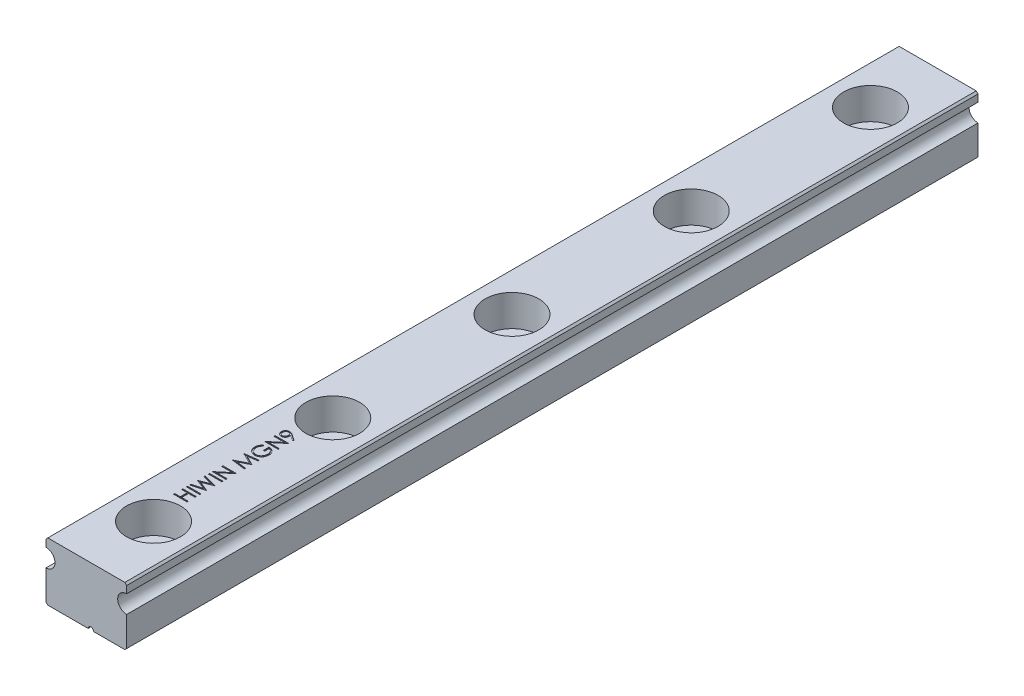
from build123d import *

# Parameters (mm, degrees)
EXTRUDE_1_DEPTH              = 95
HOLE_WIZARD_M3_1_D           = 3.5
HOLE_WIZARD_M3_1_CBORE_D     = 6
HOLE_WIZARD_M3_1_CBORE_DEPTH = 3.5
PATTERN_LINEAR_1_COUNT       = 5
PATTERN_LINEAR_1_PITCH       = 20
SKETCH_6_W                   = 1.5
SKETCH_6_H                   = 0.134615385
CUT_EXTRUDE_1_DEPTH          = 0.1


with BuildPart() as part:
    # Sketch 1 → Extrude 1 (new body)
    with BuildSketch(Plane.XY):
        with BuildLine():
            Line((4.5, 5.5), (4.5, 6.3))
            Line((4.5, 6.3), (4.3, 6.5))
            Line((4.3, 6.5), (-4.3, 6.5))
            Line((-4.3, 6.5), (-4.5, 6.3))
            Line((-4.5, 6.3), (-4.5, 5.5))
            ThreePointArc((-4.5, 5.5), (-3.5, 4.5), (-4.5, 3.5))
            Line((-4.5, 3.5), (-4.5, 0.2))
            Line((-4.5, 0.2), (-4.3, 0))
            Line((-4.3, 0), (0.2, 0))
            ThreePointArc((0.2, 0), (0.5, 0.3), (0.8, 0))
            Line((0.8, 0), (4.3, 0))
            Line((4.3, 0), (4.5, 0.2))
            Line((4.5, 0.2), (4.5, 3.5))
            ThreePointArc((4.5, 3.5), (3.5, 4.5), (4.5, 5.5))
        make_face()
    extrude(amount=-EXTRUDE_1_DEPTH)

    # Hole Wizard M3 _1 (through all)
    with Locations(Plane(origin=(0.754900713, 6.5, 19.343475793), x_dir=(-1, 0, 0), z_dir=(0, 1, 0))):
        with Locations((0.754900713, -26.843475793)):
            hole_wizard_m3_1 = CounterBoreHole(HOLE_WIZARD_M3_1_D / 2, HOLE_WIZARD_M3_1_CBORE_D / 2, HOLE_WIZARD_M3_1_CBORE_DEPTH)

    # Pattern Linear 1: Hole Wizard M3 _1 ×5
    with Locations(*[(0, 0, -i * PATTERN_LINEAR_1_PITCH) for i in range(1, PATTERN_LINEAR_1_COUNT)]):
        add(hole_wizard_m3_1, mode=Mode.SUBTRACT)

    # Sketch 6 → Cut-Extrude 1 (cut)
    # profile 1 of 9: a face of its own
    with BuildSketch(Plane(origin=(0, 6.5, 0), x_dir=(1, 0, 0), z_dir=(0, 1, 0))):
        Polygon((-1.5, 11.240384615), (-1.5, 11.375), (-0.884615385, 11.375), (-0.884615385, 12.144230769), (-1.5, 12.144230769), (-1.5, 12.278846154), (0, 12.278846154), (0, 12.144230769), (-0.730769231, 12.144230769), (-0.730769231, 11.375), (0, 11.375), (0, 11.240384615), align=None)
    # profile 2 of 9: a face of its own
    with BuildSketch(Plane(origin=(0, 6.5, 0), x_dir=(1, 0, 0), z_dir=(0, 1, 0))):
        with Locations((-0.75, 12.73076923)):
            Rectangle(SKETCH_6_W, SKETCH_6_H)
    # profile 3 of 9: a face of its own
    with BuildSketch(Plane(origin=(0, 6.5, 0), x_dir=(1, 0, 0), z_dir=(0, 1, 0))):
        Polygon((-1.5, 13.028846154), (-1.5, 13.16796875), (-0.399939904, 13.461538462), (-1.5, 13.898137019), (-1.5, 13.917668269), (-0.407451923, 14.346153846), (-1.5, 14.641225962), (-1.5, 14.778846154), (0, 14.374399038), (0, 14.355168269), (-1.147235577, 13.903846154), (0, 13.447115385), (0, 13.427884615), align=None)
    # profile 4 of 9: a face of its own
    with BuildSketch(Plane(origin=(0, 6.5, 0), x_dir=(1, 0, 0), z_dir=(0, 1, 0))):
        with Locations((-0.75, 15.192307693)):
            Rectangle(SKETCH_6_W, SKETCH_6_H)
    # profile 5 of 9: a face of its own
    with BuildSketch(Plane(origin=(0, 6.5, 0), x_dir=(1, 0, 0), z_dir=(0, 1, 0))):
        Polygon((0, 15.586538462), (-1.5, 15.586538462), (-1.5, 15.614783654), (-0.319411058, 16.605769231), (-1.5, 16.605769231), (-1.5, 16.740384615), (0, 16.740384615), (0, 16.709735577), (-1.177884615, 15.721153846), (0, 15.721153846), align=None)
    # profile 6 of 9: a face of its own
    with BuildSketch(Plane(origin=(0, 6.5, 0), x_dir=(1, 0, 0), z_dir=(0, 1, 0))):
        Polygon((0, 17.625), (-1.5, 17.823016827), (-1.5, 17.842247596), (-0.269230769, 18.461538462), (-1.5, 19.079326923), (-1.5, 19.098858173), (0, 19.298076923), (0, 19.162860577), (-1.079326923, 19.019230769), (0, 18.477764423), (0, 18.447415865), (-1.081730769, 17.903846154), (0, 17.760516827), align=None)
    # profile 7 of 9: a face of its own
    with BuildSketch(Plane(origin=(0, 6.5, 0), x_dir=(1, 0, 0), z_dir=(0, 1, 0))):
        with BuildLine():
            Line((-1.243990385, 21.009615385), (-1.134615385, 20.894230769))
            add(Edge.make_bspline(
                [(-1.134615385, 20.894230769), (-1.154263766, 20.873355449), (-1.193092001, 20.832102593), (-1.243390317, 20.764731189), (-1.28690443, 20.694721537), (-1.322045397, 20.621960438), (-1.349611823, 20.548355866), (-1.369650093, 20.475173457), (-1.382340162, 20.402887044), (-1.383864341, 20.354816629), (-1.384615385, 20.331129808)],
                knots=[0, 0, 0, 0, 1.089067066, 2.152164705, 3.18986567, 4.218445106, 5.218487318, 6.173592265, 7.100032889, 8, 8, 8, 8], degree=3))
            add(Edge.make_bspline(
                [(-1.384615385, 20.331129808), (-1.384438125, 20.316594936), (-1.384084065, 20.28756289), (-1.379565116, 20.2444392), (-1.373065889, 20.201767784), (-1.363662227, 20.159629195), (-1.351744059, 20.1179415), (-1.336836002, 20.076849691), (-1.319455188, 20.036277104), (-1.299371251, 19.996605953), (-1.277308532, 19.958145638), (-1.252858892, 19.92182164), (-1.226807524, 19.887400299), (-1.198496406, 19.855536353), (-1.168203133, 19.826017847), (-1.136473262, 19.798301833), (-1.102682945, 19.772904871), (-1.066971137, 19.750282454), (-1.030168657, 19.729853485), (-0.992587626, 19.712199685), (-0.954576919, 19.696852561), (-0.915850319, 19.685163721), (-0.876807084, 19.675263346), (-0.837242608, 19.668371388), (-0.797053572, 19.664472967), (-0.770140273, 19.663799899), (-0.756610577, 19.663461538)],
                knots=[0, 0, 0, 0, 1.028150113, 2.053633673, 3.06513288, 4.081487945, 5.106702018, 6.131327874, 7.172780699, 8.228344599, 9.276313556, 10.308389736, 11.324843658, 12.329040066, 13.321460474, 14.316307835, 15.308626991, 16.309440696, 17.305625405, 18.28535951, 19.246194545, 20.203493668, 21.145557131, 22.095268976, 23.042464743, 24, 24, 24, 24], degree=3))
            add(Edge.make_bspline(
                [(-0.756610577, 19.663461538), (-0.742780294, 19.663785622), (-0.715157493, 19.664432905), (-0.673930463, 19.668569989), (-0.633320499, 19.676265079), (-0.593263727, 19.686470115), (-0.553680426, 19.699444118), (-0.514611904, 19.715383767), (-0.476061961, 19.73437211), (-0.438413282, 19.756302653), (-0.401770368, 19.780520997), (-0.36696502, 19.807157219), (-0.334402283, 19.836256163), (-0.303606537, 19.867284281), (-0.274772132, 19.90052428), (-0.248246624, 19.93629865), (-0.223619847, 19.974106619), (-0.201162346, 20.013964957), (-0.181102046, 20.055452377), (-0.163263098, 20.097990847), (-0.14857199, 20.141717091), (-0.136598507, 20.186401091), (-0.126784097, 20.231989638), (-0.120470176, 20.278714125), (-0.115888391, 20.326231), (-0.11555339, 20.358261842), (-0.115384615, 20.374399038)],
                knots=[0, 0, 0, 0, 0.935915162, 1.869274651, 2.799799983, 3.730201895, 4.664668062, 5.616159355, 6.583070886, 7.570012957, 8.562524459, 9.553461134, 10.53281078, 11.515274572, 12.509912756, 13.507571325, 14.526460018, 15.561318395, 16.601025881, 17.643204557, 18.680545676, 19.719612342, 20.772381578, 21.833430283, 22.908478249, 24, 24, 24, 24], degree=3))
            add(Edge.make_bspline(
                [(-0.115384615, 20.374399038), (-0.11579098, 20.393846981), (-0.116588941, 20.432036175), (-0.122805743, 20.488172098), (-0.132502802, 20.542091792), (-0.14674811, 20.593619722), (-0.164779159, 20.642942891), (-0.187077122, 20.689879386), (-0.213407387, 20.734558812), (-0.24323677, 20.776787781), (-0.276471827, 20.815562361), (-0.312015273, 20.850851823), (-0.350327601, 20.881442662), (-0.390837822, 20.908248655), (-0.433933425, 20.930404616), (-0.479374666, 20.948595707), (-0.527189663, 20.962538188), (-0.560228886, 20.968261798), (-0.576923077, 20.971153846)],
                knots=[0, 0, 0, 0, 1.130199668, 2.219330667, 3.279027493, 4.311506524, 5.322739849, 6.327972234, 7.327472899, 8.33386792, 9.329086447, 10.29244429, 11.240784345, 12.174119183, 13.111530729, 14.052100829, 15.015757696, 16, 16, 16, 16], degree=3))
            Line((-0.576923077, 20.971153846), (-0.576923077, 20.471153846))
            Line((-0.576923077, 20.471153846), (-0.730769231, 20.471153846))
            Line((-0.730769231, 20.471153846), (-0.730769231, 21.105769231))
            add(Edge.make_bspline(
                [(-0.730769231, 21.105769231), (-0.702094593, 21.105038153), (-0.645973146, 21.103607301), (-0.564128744, 21.093570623), (-0.48682659, 21.077363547), (-0.413985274, 21.055223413), (-0.34570802, 21.026562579), (-0.281925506, 20.991688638), (-0.223049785, 20.950043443), (-0.168600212, 20.903110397), (-0.12003055, 20.850438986), (-0.077342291, 20.793452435), (-0.041384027, 20.732056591), (-0.012129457, 20.666309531), (0.010702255, 20.596426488), (0.026890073, 20.522245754), (0.036588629, 20.443867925), (0.037827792, 20.390152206), (0.038461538, 20.362680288)],
                knots=[0, 0, 0, 0, 1.140356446, 2.231883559, 3.274166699, 4.278491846, 5.25512956, 6.21435461, 7.1637429, 8.11826594, 9.068280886, 10.0076534, 10.945064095, 11.891975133, 12.864533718, 13.863980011, 14.907571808, 16, 16, 16, 16], degree=3))
            add(Edge.make_bspline(
                [(0.038461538, 20.362680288), (0.038217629, 20.345747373), (0.037736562, 20.312350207), (0.034317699, 20.263025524), (0.029054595, 20.215060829), (0.021106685, 20.168463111), (0.011371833, 20.123060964), (-0.001093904, 20.079081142), (-0.015523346, 20.03635611), (-0.031935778, 19.994819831), (-0.050952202, 19.95484931), (-0.072084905, 19.916266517), (-0.095224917, 19.878858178), (-0.120772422, 19.842879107), (-0.148536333, 19.808141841), (-0.178572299, 19.774870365), (-0.210788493, 19.742878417), (-0.233665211, 19.722838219), (-0.245192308, 19.712740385)],
                knots=[0, 0, 0, 0, 1.107784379, 2.184907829, 3.233506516, 4.263428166, 5.276301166, 6.270063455, 7.25232949, 8.225834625, 9.190232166, 10.146266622, 11.1027726, 12.066435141, 13.031522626, 14.010570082, 14.99756817, 16, 16, 16, 16], degree=3))
            add(Edge.make_bspline(
                [(-0.245192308, 19.712740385), (-0.26347973, 19.698089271), (-0.299751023, 19.669030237), (-0.357865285, 19.631625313), (-0.418037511, 19.599738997), (-0.480435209, 19.573867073), (-0.545000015, 19.553665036), (-0.611649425, 19.539176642), (-0.680469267, 19.530687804), (-0.727040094, 19.52946486), (-0.750600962, 19.528846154)],
                knots=[0, 0, 0, 0, 1.023165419, 2.029347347, 3.013907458, 3.994755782, 4.975994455, 5.96558838, 6.970761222, 8, 8, 8, 8], degree=3))
            add(Edge.make_bspline(
                [(-0.750600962, 19.528846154), (-0.768243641, 19.529074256), (-0.803304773, 19.529527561), (-0.855357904, 19.535024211), (-0.906486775, 19.542910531), (-0.956649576, 19.554502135), (-1.005879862, 19.569114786), (-1.054200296, 19.587352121), (-1.101640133, 19.608585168), (-1.147870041, 19.633266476), (-1.192287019, 19.660724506), (-1.234673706, 19.690556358), (-1.274343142, 19.722992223), (-1.311387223, 19.758126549), (-1.346354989, 19.795251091), (-1.378516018, 19.83514522), (-1.408373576, 19.877204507), (-1.435353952, 19.921754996), (-1.459597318, 19.968093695), (-1.480849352, 20.016119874), (-1.498413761, 20.065816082), (-1.513316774, 20.116810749), (-1.524337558, 20.169489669), (-1.532329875, 20.223470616), (-1.537798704, 20.279034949), (-1.538238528, 20.316593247), (-1.538461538, 20.335637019)],
                knots=[0, 0, 0, 0, 1.00895651, 2.005089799, 2.991467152, 3.967318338, 4.948153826, 5.927364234, 6.919980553, 7.91976625, 8.923240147, 9.905815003, 10.88314567, 11.851989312, 12.825009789, 13.798721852, 14.781296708, 15.773896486, 16.776076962, 17.771600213, 18.775744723, 19.78957137, 20.808953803, 21.851964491, 22.910847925, 24, 24, 24, 24], degree=3))
            add(Edge.make_bspline(
                [(-1.538461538, 20.335637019), (-1.538213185, 20.351167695), (-1.537720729, 20.3819632), (-1.534307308, 20.427788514), (-1.528897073, 20.47290552), (-1.521514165, 20.517381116), (-1.511458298, 20.561063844), (-1.499424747, 20.604078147), (-1.485413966, 20.646486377), (-1.46870446, 20.688155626), (-1.449738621, 20.729366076), (-1.428390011, 20.770346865), (-1.404293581, 20.81095797), (-1.37737778, 20.851269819), (-1.348104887, 20.891536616), (-1.315637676, 20.931121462), (-1.281256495, 20.970979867), (-1.256535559, 20.996609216), (-1.243990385, 21.009615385)],
                knots=[0, 0, 0, 0, 0.985871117, 1.954866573, 2.915460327, 3.869826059, 4.81536089, 5.759505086, 6.70452669, 7.649098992, 8.607881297, 9.583363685, 10.581137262, 11.603961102, 12.659522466, 13.73993555, 14.853081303, 16, 16, 16, 16], degree=3))
        make_face()
    # profile 8 of 9: a face of its own
    with BuildSketch(Plane(origin=(0, 6.5, 0), x_dir=(1, 0, 0), z_dir=(0, 1, 0))):
        Polygon((0, 21.413461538), (-1.5, 21.413461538), (-1.5, 21.441706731), (-0.319411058, 22.432692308), (-1.5, 22.432692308), (-1.5, 22.567307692), (0, 22.567307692), (0, 22.536658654), (-1.177884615, 21.548076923), (0, 21.548076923), align=None)
    # profile 9 of 9: a face of its own
    with BuildSketch(Plane(origin=(0, 6.5, 0), x_dir=(1, 0, 0), z_dir=(0, 1, 0))):
        with BuildLine():
            Line((0.038461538, 23.144230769), (-0.036358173, 23.036658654))
            Line((-0.036358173, 23.036658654), (-0.646033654, 23.453725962))
            add(Edge.make_bspline(
                [(-0.646033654, 23.453725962), (-0.642627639, 23.427119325), (-0.635922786, 23.374743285), (-0.635046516, 23.321948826), (-0.634615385, 23.295973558)],
                knots=[0, 0, 0, 0, 1.015985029, 2, 2, 2, 2], degree=3))
            add(Edge.make_bspline(
                [(-0.634615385, 23.295973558), (-0.635018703, 23.280226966), (-0.635810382, 23.249317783), (-0.642085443, 23.203875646), (-0.651749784, 23.160210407), (-0.666170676, 23.11843782), (-0.684092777, 23.078400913), (-0.706317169, 23.040186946), (-0.732462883, 23.003847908), (-0.762390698, 22.969771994), (-0.79525498, 22.938786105), (-0.830027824, 22.911158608), (-0.867084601, 22.88832306), (-0.905643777, 22.869014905), (-0.946528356, 22.854782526), (-0.989044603, 22.844167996), (-1.033456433, 22.83770465), (-1.063680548, 22.836931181), (-1.079026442, 22.836538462)],
                knots=[0, 0, 0, 0, 1.060698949, 2.082059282, 3.085738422, 4.069684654, 5.054463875, 6.037298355, 7.043153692, 8.066652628, 9.088369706, 10.083456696, 11.053578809, 12.016466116, 12.983507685, 13.964045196, 14.966270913, 16, 16, 16, 16], degree=3))
            add(Edge.make_bspline(
                [(-1.079026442, 22.836538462), (-1.100012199, 22.837283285), (-1.141202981, 22.838745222), (-1.201400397, 22.850466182), (-1.258351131, 22.869885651), (-1.3119915, 22.896537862), (-1.361089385, 22.93075081), (-1.405478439, 22.97138122), (-1.444366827, 23.018757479), (-1.477757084, 23.071642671), (-1.504794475, 23.128718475), (-1.524003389, 23.188742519), (-1.536274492, 23.250703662), (-1.537729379, 23.292811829), (-1.538461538, 23.314002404)],
                knots=[0, 0, 0, 0, 1.023011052, 2.007963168, 2.978169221, 3.950402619, 4.919353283, 5.887490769, 6.876420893, 7.899700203, 8.931203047, 9.947778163, 10.96723692, 12, 12, 12, 12], degree=3))
            add(Edge.make_bspline(
                [(-1.538461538, 23.314002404), (-1.537677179, 23.334783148), (-1.536127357, 23.375843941), (-1.524777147, 23.436225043), (-1.505646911, 23.494056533), (-1.479211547, 23.54902008), (-1.446070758, 23.599903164), (-1.406596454, 23.645683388), (-1.360755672, 23.685145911), (-1.309807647, 23.71879079), (-1.25472961, 23.745295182), (-1.197347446, 23.764716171), (-1.138006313, 23.776587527), (-1.097810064, 23.7780886), (-1.077524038, 23.778846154)],
                knots=[0, 0, 0, 0, 1.026358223, 2.027987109, 3.023239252, 4.028077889, 5.032770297, 6.015020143, 7.004250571, 8.011656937, 9.02310243, 10.015224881, 10.998334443, 12, 12, 12, 12], degree=3))
            add(Edge.make_bspline(
                [(-1.077524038, 23.778846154), (-1.061777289, 23.778338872), (-1.029838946, 23.777309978), (-0.981399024, 23.770187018), (-0.932048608, 23.757900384), (-0.890237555, 23.744171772), (-0.855599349, 23.730715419), (-0.828157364, 23.718414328), (-0.799474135, 23.704124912), (-0.769432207, 23.688166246), (-0.737992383, 23.670568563), (-0.705372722, 23.650853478), (-0.671525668, 23.629286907), (-0.648704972, 23.613932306), (-0.637019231, 23.606069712)],
                knots=[0, 0, 0, 0, 1.179894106, 2.393120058, 3.660107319, 4.986885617, 5.687958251, 6.443931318, 7.239444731, 8.088894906, 8.992865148, 9.938946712, 10.944601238, 12, 12, 12, 12], degree=3))
            Line((-0.637019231, 23.606069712), (0.038461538, 23.144230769))
        make_face()
        with BuildLine():
            add(Edge.make_bspline(
                [(-0.788461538, 23.320913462), (-0.788788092, 23.332842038), (-0.789423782, 23.356062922), (-0.793275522, 23.390085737), (-0.800155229, 23.422181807), (-0.809870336, 23.452557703), (-0.822177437, 23.481176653), (-0.837175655, 23.508047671), (-0.855193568, 23.532896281), (-0.875446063, 23.55581095), (-0.897641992, 23.576606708), (-0.92142287, 23.594537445), (-0.946049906, 23.610062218), (-0.972027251, 23.622447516), (-0.998929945, 23.632428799), (-1.027147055, 23.639393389), (-1.056483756, 23.643240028), (-1.076411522, 23.643896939), (-1.086538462, 23.644230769)],
                knots=[0, 0, 0, 0, 1.163726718, 2.265380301, 3.334713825, 4.36057981, 5.371541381, 6.368955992, 7.355979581, 8.359691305, 9.348261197, 10.317521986, 11.261029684, 12.183096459, 13.119698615, 14.055740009, 15.011961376, 16, 16, 16, 16], degree=3))
            add(Edge.make_bspline(
                [(-1.086538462, 23.644230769), (-1.096669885, 23.643944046), (-1.116635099, 23.643379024), (-1.146011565, 23.638837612), (-1.174173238, 23.630870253), (-1.201311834, 23.620071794), (-1.227278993, 23.60611642), (-1.252156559, 23.589207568), (-1.27556797, 23.56878977), (-1.297899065, 23.54597379), (-1.318157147, 23.520878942), (-1.336055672, 23.494290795), (-1.351161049, 23.466351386), (-1.363089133, 23.43693608), (-1.37286104, 23.406444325), (-1.379778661, 23.37456046), (-1.383632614, 23.341240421), (-1.384283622, 23.318619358), (-1.384615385, 23.307091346)],
                knots=[0, 0, 0, 0, 0.971910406, 1.91526867, 2.84337505, 3.775008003, 4.712374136, 5.666733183, 6.654995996, 7.688089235, 8.726800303, 9.745078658, 10.75990398, 11.768337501, 12.786615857, 13.829099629, 14.893678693, 16, 16, 16, 16], degree=3))
            add(Edge.make_bspline(
                [(-1.384615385, 23.307091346), (-1.384283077, 23.295663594), (-1.383631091, 23.273242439), (-1.379786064, 23.240218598), (-1.372814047, 23.208550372), (-1.363093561, 23.178147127), (-1.351160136, 23.148732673), (-1.336054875, 23.120794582), (-1.318161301, 23.094200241), (-1.297882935, 23.069129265), (-1.275672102, 23.046272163), (-1.252051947, 23.026199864), (-1.227292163, 23.009252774), (-1.201308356, 22.995316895), (-1.174174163, 22.98451328), (-1.146011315, 22.976547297), (-1.116635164, 22.972005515), (-1.096669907, 22.971440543), (-1.086538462, 22.971153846)],
                knots=[0, 0, 0, 0, 1.099107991, 2.156440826, 3.191784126, 4.212280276, 5.222910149, 6.239945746, 7.260441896, 8.30141526, 9.33675856, 10.320924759, 11.277362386, 12.216770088, 13.150432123, 14.080559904, 15.025972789, 16, 16, 16, 16], degree=3))
            add(Edge.make_bspline(
                [(-1.086538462, 22.971153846), (-1.076403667, 22.971413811), (-1.056415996, 22.971926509), (-1.02704542, 22.976862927), (-0.998901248, 22.985140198), (-0.971743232, 22.996115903), (-0.945922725, 23.010845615), (-0.921305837, 23.028746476), (-0.897389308, 23.049401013), (-0.875515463, 23.073486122), (-0.855096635, 23.099349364), (-0.837288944, 23.127129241), (-0.822356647, 23.156267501), (-0.809834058, 23.186577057), (-0.800253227, 23.218284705), (-0.793288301, 23.251346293), (-0.789460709, 23.285767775), (-0.788797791, 23.309085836), (-0.788461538, 23.320913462)],
                knots=[0, 0, 0, 0, 0.952872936, 1.879239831, 2.791748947, 3.708674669, 4.628500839, 5.580394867, 6.568761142, 7.595635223, 8.636123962, 9.665976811, 10.694276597, 11.712685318, 12.747011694, 13.805940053, 14.887106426, 16, 16, 16, 16], degree=3))
        make_face(mode=Mode.SUBTRACT)
    extrude(amount=-CUT_EXTRUDE_1_DEPTH, mode=Mode.SUBTRACT)


solid = part.part
